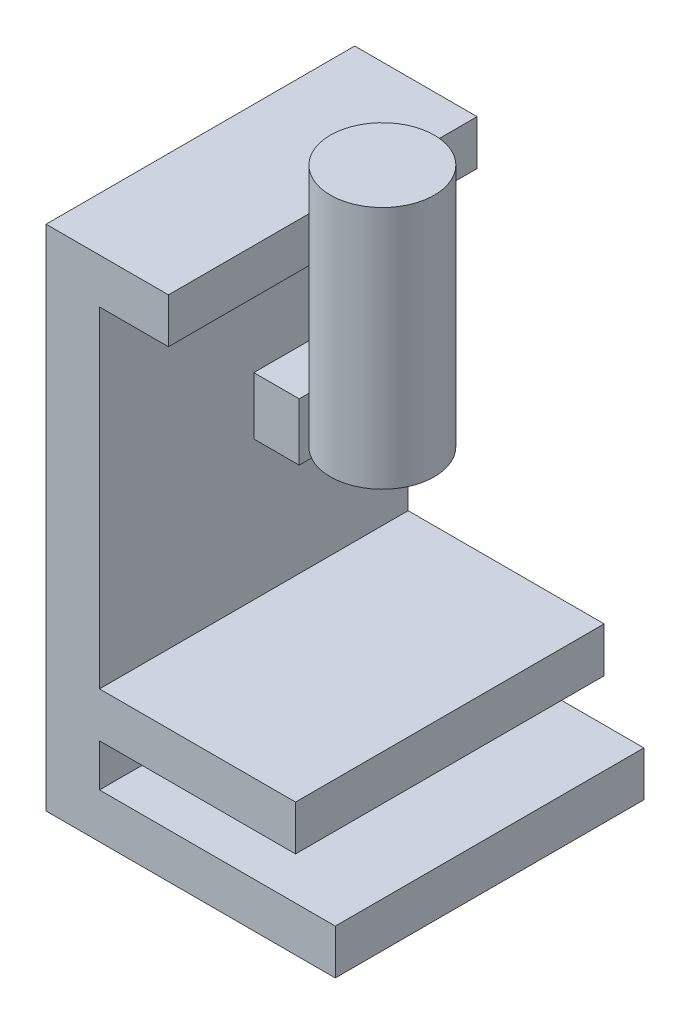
ISO-10303-21;
HEADER;
FILE_DESCRIPTION(('STEP AP214'),'2;1');
FILE_NAME('part.step','',(''),(''),'','','');
FILE_SCHEMA(('AUTOMOTIVE_DESIGN { 1 0 10303 214 1 1 1 1 }'));
ENDSEC;
DATA;
#1=APPLICATION_CONTEXT('core data for automotive mechanical design processes');
#2=APPLICATION_PROTOCOL_DEFINITION('international standard','automotive_design',2000,#1);
#3=PRODUCT_CONTEXT('',#1,'mechanical');
#4=PRODUCT('Part','Part','',(#3));
#5=PRODUCT_RELATED_PRODUCT_CATEGORY('part','',(#4));
#6=PRODUCT_DEFINITION_FORMATION('','',#4);
#7=PRODUCT_DEFINITION_CONTEXT('part definition',#1,'design');
#8=PRODUCT_DEFINITION('design','',#6,#7);
#9=PRODUCT_DEFINITION_SHAPE('','',#8);
#10=(LENGTH_UNIT() NAMED_UNIT(*) SI_UNIT(.MILLI.,.METRE.));
#11=(NAMED_UNIT(*) PLANE_ANGLE_UNIT() SI_UNIT($,.RADIAN.));
#12=(NAMED_UNIT(*) SI_UNIT($,.STERADIAN.) SOLID_ANGLE_UNIT());
#13=UNCERTAINTY_MEASURE_WITH_UNIT(LENGTH_MEASURE(1.E-05),#10,'distance_accuracy_value','');
#14=(GEOMETRIC_REPRESENTATION_CONTEXT(3) GLOBAL_UNCERTAINTY_ASSIGNED_CONTEXT((#13)) GLOBAL_UNIT_ASSIGNED_CONTEXT((#10,
#11,#12)) REPRESENTATION_CONTEXT('',''));
#15=CARTESIAN_POINT('',(0.,0.,0.));
#16=DIRECTION('',(0.,0.,1.));
#17=DIRECTION('',(1.,0.,0.));
#18=AXIS2_PLACEMENT_3D('',#15,#16,#17);
#19=CARTESIAN_POINT('',(118.997137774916,14.7914505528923,0.));
#20=DIRECTION('',(0.,1.,0.));
#21=DIRECTION('',(-1.,0.,0.));
#22=AXIS2_PLACEMENT_3D('',#19,#20,#21);
#23=CYLINDRICAL_SURFACE('',#22,15.9977414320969);
#24=CARTESIAN_POINT('',(118.997137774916,14.7914505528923,0.));
#25=DIRECTION('',(0.,1.,0.));
#26=DIRECTION('',(-1.,0.,0.));
#27=AXIS2_PLACEMENT_3D('',#24,#25,#26);
#28=CIRCLE('',#27,15.9977414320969);
#29=CARTESIAN_POINT('',(102.999396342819,14.7914505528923,0.));
#30=VERTEX_POINT('',#29);
#31=EDGE_CURVE('E11',#30,#30,#28,.T.);
#32=ORIENTED_EDGE('',*,*,#31,.T.);
#33=EDGE_LOOP('',(#32));
#34=FACE_BOUND('',#33,.T.);
#35=CARTESIAN_POINT('',(118.997137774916,89.8894366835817,0.));
#36=DIRECTION('',(0.,1.,0.));
#37=DIRECTION('',(-1.,0.,0.));
#38=AXIS2_PLACEMENT_3D('',#35,#36,#37);
#39=CIRCLE('',#38,15.9977414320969);
#40=CARTESIAN_POINT('',(102.999396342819,89.8894366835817,0.));
#41=VERTEX_POINT('',#40);
#42=EDGE_CURVE('E43',#41,#41,#39,.T.);
#43=ORIENTED_EDGE('',*,*,#42,.F.);
#44=EDGE_LOOP('',(#43));
#45=FACE_BOUND('',#44,.T.);
#46=ADVANCED_FACE('F40',(#34,#45),#23,.T.);
#47=CARTESIAN_POINT('',(118.997137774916,14.7914505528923,0.));
#48=DIRECTION('',(0.,1.,0.));
#49=DIRECTION('',(-1.,0.,0.));
#50=AXIS2_PLACEMENT_3D('',#47,#48,#49);
#51=PLANE('',#50);
#52=ORIENTED_EDGE('',*,*,#31,.F.);
#53=EDGE_LOOP('',(#52));
#54=FACE_BOUND('',#53,.T.);
#55=ADVANCED_FACE('F55',(#54),#51,.F.);
#56=CARTESIAN_POINT('',(118.997137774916,89.8894366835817,0.));
#57=DIRECTION('',(0.,1.,0.));
#58=DIRECTION('',(-1.,0.,0.));
#59=AXIS2_PLACEMENT_3D('',#56,#57,#58);
#60=PLANE('',#59);
#61=ORIENTED_EDGE('',*,*,#42,.T.);
#62=EDGE_LOOP('',(#61));
#63=FACE_BOUND('',#62,.T.);
#64=ADVANCED_FACE('F52',(#63),#60,.T.);
#65=CLOSED_SHELL('',(#46,#55,#64));
#66=MANIFOLD_SOLID_BREP('B2',#65);
#67=CARTESIAN_POINT('',(139.766211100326,-45.7667519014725,47.5));
#68=DIRECTION('',(0.,-1.,0.));
#69=DIRECTION('',(0.,0.,-1.));
#70=AXIS2_PLACEMENT_3D('',#67,#68,#69);
#71=PLANE('',#70);
#72=DIRECTION('',(-1.,0.,0.));
#73=VECTOR('',#72,1.);
#74=CARTESIAN_POINT('',(139.766211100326,-45.7667519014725,-47.5));
#75=LINE('',#74,#73);
#76=CARTESIAN_POINT('',(139.766211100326,-45.7667519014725,-47.5));
#77=VERTEX_POINT('',#76);
#78=CARTESIAN_POINT('',(79.4274220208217,-45.7667519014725,-47.5));
#79=VERTEX_POINT('',#78);
#80=EDGE_CURVE('E209',#77,#79,#75,.T.);
#81=ORIENTED_EDGE('',*,*,#80,.T.);
#82=DIRECTION('',(0.,0.,-1.));
#83=VECTOR('',#82,1.);
#84=CARTESIAN_POINT('',(79.4274220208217,-45.7667519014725,47.5));
#85=LINE('',#84,#83);
#86=CARTESIAN_POINT('',(79.4274220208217,-45.7667519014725,47.5));
#87=VERTEX_POINT('',#86);
#88=EDGE_CURVE('E38',#87,#79,#85,.T.);
#89=ORIENTED_EDGE('',*,*,#88,.F.);
#90=DIRECTION('',(-1.,0.,0.));
#91=VECTOR('',#90,1.);
#92=CARTESIAN_POINT('',(139.766211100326,-45.7667519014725,47.5));
#93=LINE('',#92,#91);
#94=CARTESIAN_POINT('',(139.766211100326,-45.7667519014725,47.5));
#95=VERTEX_POINT('',#94);
#96=EDGE_CURVE('E273',#95,#87,#93,.T.);
#97=ORIENTED_EDGE('',*,*,#96,.F.);
#98=DIRECTION('',(0.,0.,-1.));
#99=VECTOR('',#98,1.);
#100=CARTESIAN_POINT('',(139.766211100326,-45.7667519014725,47.5));
#101=LINE('',#100,#99);
#102=EDGE_CURVE('E250',#95,#77,#101,.T.);
#103=ORIENTED_EDGE('',*,*,#102,.T.);
#104=EDGE_LOOP('',(#81,#89,#97,#103));
#105=FACE_BOUND('',#104,.T.);
#106=ADVANCED_FACE('F80',(#105),#71,.F.);
#107=CARTESIAN_POINT('',(79.4274220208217,-2.89157012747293,47.5));
#108=DIRECTION('',(0.,1.,0.));
#109=DIRECTION('',(0.,0.,1.));
#110=AXIS2_PLACEMENT_3D('',#107,#108,#109);
#111=PLANE('',#110);
#112=DIRECTION('',(0.,0.,-1.));
#113=VECTOR('',#112,1.);
#114=CARTESIAN_POINT('',(93.3999473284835,-2.89157012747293,47.5));
#115=LINE('',#114,#113);
#116=CARTESIAN_POINT('',(93.3999473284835,-2.89157012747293,0.));
#117=VERTEX_POINT('',#116);
#118=CARTESIAN_POINT('',(93.3999473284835,-2.89157012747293,-47.5));
#119=VERTEX_POINT('',#118);
#120=EDGE_CURVE('E208',#117,#119,#115,.T.);
#121=ORIENTED_EDGE('',*,*,#120,.F.);
#122=DIRECTION('',(1.,0.,0.));
#123=VECTOR('',#122,1.);
#124=CARTESIAN_POINT('',(79.4274220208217,-2.89157012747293,0.));
#125=LINE('',#124,#123);
#126=CARTESIAN_POINT('',(79.4274220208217,-2.89157012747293,0.));
#127=VERTEX_POINT('',#126);
#128=EDGE_CURVE('E194',#127,#117,#125,.T.);
#129=ORIENTED_EDGE('',*,*,#128,.F.);
#130=DIRECTION('',(0.,0.,-1.));
#131=VECTOR('',#130,1.);
#132=CARTESIAN_POINT('',(79.4274220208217,-2.89157012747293,47.5));
#133=LINE('',#132,#131);
#134=CARTESIAN_POINT('',(79.4274220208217,-2.89157012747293,-47.5));
#135=VERTEX_POINT('',#134);
#136=EDGE_CURVE('E87',#127,#135,#133,.T.);
#137=ORIENTED_EDGE('',*,*,#136,.T.);
#138=DIRECTION('',(1.,0.,0.));
#139=VECTOR('',#138,1.);
#140=CARTESIAN_POINT('',(79.4274220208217,-2.89157012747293,-47.5));
#141=LINE('',#140,#139);
#142=EDGE_CURVE('E303',#135,#119,#141,.T.);
#143=ORIENTED_EDGE('',*,*,#142,.T.);
#144=EDGE_LOOP('',(#121,#129,#137,#143));
#145=FACE_BOUND('',#144,.T.);
#146=ADVANCED_FACE('F205',(#145),#111,.F.);
#147=CARTESIAN_POINT('',(93.3999473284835,-2.89157012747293,47.5));
#148=DIRECTION('',(-1.,0.,0.));
#149=DIRECTION('',(0.,0.,1.));
#150=AXIS2_PLACEMENT_3D('',#147,#148,#149);
#151=PLANE('',#150);
#152=DIRECTION('',(0.,0.,-1.));
#153=VECTOR('',#152,1.);
#154=CARTESIAN_POINT('',(93.3999473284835,14.7914505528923,47.5));
#155=LINE('',#154,#153);
#156=CARTESIAN_POINT('',(93.3999473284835,14.7914505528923,0.));
#157=VERTEX_POINT('',#156);
#158=CARTESIAN_POINT('',(93.3999473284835,14.7914505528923,-47.5));
#159=VERTEX_POINT('',#158);
#160=EDGE_CURVE('E214',#157,#159,#155,.T.);
#161=ORIENTED_EDGE('',*,*,#160,.F.);
#162=DIRECTION('',(0.,1.,0.));
#163=VECTOR('',#162,1.);
#164=CARTESIAN_POINT('',(93.3999473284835,-86.5522105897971,0.));
#165=LINE('',#164,#163);
#166=EDGE_CURVE('E201',#117,#157,#165,.T.);
#167=ORIENTED_EDGE('',*,*,#166,.F.);
#168=ORIENTED_EDGE('',*,*,#120,.T.);
#169=DIRECTION('',(0.,1.,0.));
#170=VECTOR('',#169,1.);
#171=CARTESIAN_POINT('',(93.3999473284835,-2.89157012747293,-47.5));
#172=LINE('',#171,#170);
#173=EDGE_CURVE('E300',#119,#159,#172,.T.);
#174=ORIENTED_EDGE('',*,*,#173,.T.);
#175=EDGE_LOOP('',(#161,#167,#168,#174));
#176=FACE_BOUND('',#175,.T.);
#177=ADVANCED_FACE('F313',(#176),#151,.F.);
#178=CARTESIAN_POINT('',(93.3999473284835,14.7914505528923,47.5));
#179=DIRECTION('',(0.,-1.,0.));
#180=DIRECTION('',(0.,0.,-1.));
#181=AXIS2_PLACEMENT_3D('',#178,#179,#180);
#182=PLANE('',#181);
#183=DIRECTION('',(0.,0.,-1.));
#184=VECTOR('',#183,1.);
#185=CARTESIAN_POINT('',(79.4274220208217,14.7914505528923,47.5));
#186=LINE('',#185,#184);
#187=CARTESIAN_POINT('',(79.4274220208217,14.7914505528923,0.));
#188=VERTEX_POINT('',#187);
#189=CARTESIAN_POINT('',(79.4274220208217,14.7914505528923,-47.5));
#190=VERTEX_POINT('',#189);
#191=EDGE_CURVE('E218',#188,#190,#186,.T.);
#192=ORIENTED_EDGE('',*,*,#191,.F.);
#193=DIRECTION('',(-1.,0.,0.));
#194=VECTOR('',#193,1.);
#195=CARTESIAN_POINT('',(79.4274220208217,14.7914505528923,0.));
#196=LINE('',#195,#194);
#197=EDGE_CURVE('E197',#157,#188,#196,.T.);
#198=ORIENTED_EDGE('',*,*,#197,.F.);
#199=ORIENTED_EDGE('',*,*,#160,.T.);
#200=DIRECTION('',(-1.,0.,0.));
#201=VECTOR('',#200,1.);
#202=CARTESIAN_POINT('',(93.3999473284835,14.7914505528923,-47.5));
#203=LINE('',#202,#201);
#204=EDGE_CURVE('E297',#159,#190,#203,.T.);
#205=ORIENTED_EDGE('',*,*,#204,.T.);
#206=EDGE_LOOP('',(#192,#198,#199,#205));
#207=FACE_BOUND('',#206,.T.);
#208=ADVANCED_FACE('F312',(#207),#182,.F.);
#209=CARTESIAN_POINT('',(79.4274220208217,14.7914505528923,47.5));
#210=DIRECTION('',(-1.,0.,0.));
#211=DIRECTION('',(0.,0.,1.));
#212=AXIS2_PLACEMENT_3D('',#209,#210,#211);
#213=PLANE('',#212);
#214=DIRECTION('',(0.,1.,0.));
#215=VECTOR('',#214,1.);
#216=CARTESIAN_POINT('',(79.4274220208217,14.7914505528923,-47.5));
#217=LINE('',#216,#215);
#218=CARTESIAN_POINT('',(79.4274220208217,56.0485401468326,-47.5));
#219=VERTEX_POINT('',#218);
#220=EDGE_CURVE('E295',#190,#219,#217,.T.);
#221=ORIENTED_EDGE('',*,*,#220,.T.);
#222=DIRECTION('',(0.,0.,-1.));
#223=VECTOR('',#222,1.);
#224=CARTESIAN_POINT('',(79.4274220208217,56.0485401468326,47.5));
#225=LINE('',#224,#223);
#226=CARTESIAN_POINT('',(79.4274220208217,56.0485401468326,47.5));
#227=VERTEX_POINT('',#226);
#228=EDGE_CURVE('E220',#227,#219,#225,.T.);
#229=ORIENTED_EDGE('',*,*,#228,.F.);
#230=DIRECTION('',(0.,1.,0.));
#231=VECTOR('',#230,1.);
#232=CARTESIAN_POINT('',(79.4274220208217,-45.7667519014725,47.5));
#233=LINE('',#232,#231);
#234=EDGE_CURVE('E271',#87,#227,#233,.T.);
#235=ORIENTED_EDGE('',*,*,#234,.F.);
#236=ORIENTED_EDGE('',*,*,#88,.T.);
#237=DIRECTION('',(0.,1.,0.));
#238=VECTOR('',#237,1.);
#239=CARTESIAN_POINT('',(79.4274220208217,-45.7667519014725,-47.5));
#240=LINE('',#239,#238);
#241=EDGE_CURVE('E212',#79,#135,#240,.T.);
#242=ORIENTED_EDGE('',*,*,#241,.T.);
#243=ORIENTED_EDGE('',*,*,#136,.F.);
#244=DIRECTION('',(0.,1.,0.));
#245=VECTOR('',#244,1.);
#246=CARTESIAN_POINT('',(79.4274220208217,-86.5522105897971,0.));
#247=LINE('',#246,#245);
#248=EDGE_CURVE('E191',#127,#188,#247,.T.);
#249=ORIENTED_EDGE('',*,*,#248,.T.);
#250=ORIENTED_EDGE('',*,*,#191,.T.);
#251=EDGE_LOOP('',(#221,#229,#235,#236,#242,#243,#249,#250));
#252=FACE_BOUND('',#251,.T.);
#253=ADVANCED_FACE('F211',(#252),#213,.F.);
#254=CARTESIAN_POINT('',(79.4274220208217,56.0485401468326,47.5));
#255=DIRECTION('',(0.,1.,0.));
#256=DIRECTION('',(0.,0.,1.));
#257=AXIS2_PLACEMENT_3D('',#254,#255,#256);
#258=PLANE('',#257);
#259=DIRECTION('',(1.,0.,0.));
#260=VECTOR('',#259,1.);
#261=CARTESIAN_POINT('',(79.4274220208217,56.0485401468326,-47.5));
#262=LINE('',#261,#260);
#263=CARTESIAN_POINT('',(100.6545595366,56.0485401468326,-47.5));
#264=VERTEX_POINT('',#263);
#265=EDGE_CURVE('E293',#219,#264,#262,.T.);
#266=ORIENTED_EDGE('',*,*,#265,.T.);
#267=DIRECTION('',(0.,0.,-1.));
#268=VECTOR('',#267,1.);
#269=CARTESIAN_POINT('',(100.6545595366,56.0485401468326,47.5));
#270=LINE('',#269,#268);
#271=CARTESIAN_POINT('',(100.6545595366,56.0485401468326,47.5));
#272=VERTEX_POINT('',#271);
#273=EDGE_CURVE('E223',#272,#264,#270,.T.);
#274=ORIENTED_EDGE('',*,*,#273,.F.);
#275=DIRECTION('',(1.,0.,0.));
#276=VECTOR('',#275,1.);
#277=CARTESIAN_POINT('',(79.4274220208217,56.0485401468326,47.5));
#278=LINE('',#277,#276);
#279=EDGE_CURVE('E269',#227,#272,#278,.T.);
#280=ORIENTED_EDGE('',*,*,#279,.F.);
#281=ORIENTED_EDGE('',*,*,#228,.T.);
#282=EDGE_LOOP('',(#266,#274,#280,#281));
#283=FACE_BOUND('',#282,.T.);
#284=ADVANCED_FACE('F325',(#283),#258,.F.);
#285=CARTESIAN_POINT('',(100.6545595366,56.0485401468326,47.5));
#286=DIRECTION('',(-1.,0.,0.));
#287=DIRECTION('',(0.,0.,1.));
#288=AXIS2_PLACEMENT_3D('',#285,#286,#287);
#289=PLANE('',#288);
#290=DIRECTION('',(0.,1.,0.));
#291=VECTOR('',#290,1.);
#292=CARTESIAN_POINT('',(100.6545595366,56.0485401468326,-47.5));
#293=LINE('',#292,#291);
#294=CARTESIAN_POINT('',(100.6545595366,69.8894366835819,-47.5));
#295=VERTEX_POINT('',#294);
#296=EDGE_CURVE('E291',#264,#295,#293,.T.);
#297=ORIENTED_EDGE('',*,*,#296,.T.);
#298=DIRECTION('',(0.,0.,-1.));
#299=VECTOR('',#298,1.);
#300=CARTESIAN_POINT('',(100.6545595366,69.8894366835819,47.5));
#301=LINE('',#300,#299);
#302=CARTESIAN_POINT('',(100.6545595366,69.8894366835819,47.5));
#303=VERTEX_POINT('',#302);
#304=EDGE_CURVE('E226',#303,#295,#301,.T.);
#305=ORIENTED_EDGE('',*,*,#304,.F.);
#306=DIRECTION('',(0.,1.,0.));
#307=VECTOR('',#306,1.);
#308=CARTESIAN_POINT('',(100.6545595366,56.0485401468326,47.5));
#309=LINE('',#308,#307);
#310=EDGE_CURVE('E267',#272,#303,#309,.T.);
#311=ORIENTED_EDGE('',*,*,#310,.F.);
#312=ORIENTED_EDGE('',*,*,#273,.T.);
#313=EDGE_LOOP('',(#297,#305,#311,#312));
#314=FACE_BOUND('',#313,.T.);
#315=ADVANCED_FACE('F370',(#314),#289,.F.);
#316=CARTESIAN_POINT('',(62.9855483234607,69.8894366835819,47.5));
#317=DIRECTION('',(0.,-1.,0.));
#318=DIRECTION('',(1.,0.,0.));
#319=AXIS2_PLACEMENT_3D('',#316,#317,#318);
#320=PLANE('',#319);
#321=DIRECTION('',(-1.,0.,0.));
#322=VECTOR('',#321,1.);
#323=CARTESIAN_POINT('',(62.9855483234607,69.8894366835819,-47.5));
#324=LINE('',#323,#322);
#325=CARTESIAN_POINT('',(62.9855483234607,69.8894366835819,-47.5));
#326=VERTEX_POINT('',#325);
#327=EDGE_CURVE('E289',#295,#326,#324,.T.);
#328=ORIENTED_EDGE('',*,*,#327,.T.);
#329=DIRECTION('',(0.,0.,-1.));
#330=VECTOR('',#329,1.);
#331=CARTESIAN_POINT('',(62.9855483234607,69.8894366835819,47.5));
#332=LINE('',#331,#330);
#333=CARTESIAN_POINT('',(62.9855483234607,69.8894366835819,47.5));
#334=VERTEX_POINT('',#333);
#335=EDGE_CURVE('E229',#334,#326,#332,.T.);
#336=ORIENTED_EDGE('',*,*,#335,.F.);
#337=DIRECTION('',(-1.,0.,0.));
#338=VECTOR('',#337,1.);
#339=CARTESIAN_POINT('',(62.9855483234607,69.8894366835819,47.5));
#340=LINE('',#339,#338);
#341=EDGE_CURVE('E265',#303,#334,#340,.T.);
#342=ORIENTED_EDGE('',*,*,#341,.F.);
#343=ORIENTED_EDGE('',*,*,#304,.T.);
#344=EDGE_LOOP('',(#328,#336,#342,#343));
#345=FACE_BOUND('',#344,.T.);
#346=ADVANCED_FACE('F368',(#345),#320,.F.);
#347=CARTESIAN_POINT('',(62.9855483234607,-86.5512105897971,47.5));
#348=DIRECTION('',(1.,0.,0.));
#349=DIRECTION('',(0.,0.,-1.));
#350=AXIS2_PLACEMENT_3D('',#347,#348,#349);
#351=PLANE('',#350);
#352=DIRECTION('',(0.,-1.,0.));
#353=VECTOR('',#352,1.);
#354=CARTESIAN_POINT('',(62.9855483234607,-86.5512105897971,-47.5));
#355=LINE('',#354,#353);
#356=CARTESIAN_POINT('',(62.9855483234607,-86.5512105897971,-47.5));
#357=VERTEX_POINT('',#356);
#358=EDGE_CURVE('E287',#326,#357,#355,.T.);
#359=ORIENTED_EDGE('',*,*,#358,.T.);
#360=DIRECTION('',(0.,0.,-1.));
#361=VECTOR('',#360,1.);
#362=CARTESIAN_POINT('',(62.9855483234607,-86.5512105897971,47.5));
#363=LINE('',#362,#361);
#364=CARTESIAN_POINT('',(62.9855483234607,-86.5512105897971,47.5));
#365=VERTEX_POINT('',#364);
#366=EDGE_CURVE('E232',#365,#357,#363,.T.);
#367=ORIENTED_EDGE('',*,*,#366,.F.);
#368=DIRECTION('',(0.,-1.,0.));
#369=VECTOR('',#368,1.);
#370=CARTESIAN_POINT('',(62.9855483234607,-86.5512105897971,47.5));
#371=LINE('',#370,#369);
#372=EDGE_CURVE('E263',#334,#365,#371,.T.);
#373=ORIENTED_EDGE('',*,*,#372,.F.);
#374=ORIENTED_EDGE('',*,*,#335,.T.);
#375=EDGE_LOOP('',(#359,#367,#373,#374));
#376=FACE_BOUND('',#375,.T.);
#377=ADVANCED_FACE('F363',(#376),#351,.F.);
#378=CARTESIAN_POINT('',(152.004557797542,-86.5512105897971,47.5));
#379=DIRECTION('',(0.,1.,0.));
#380=DIRECTION('',(0.,0.,1.));
#381=AXIS2_PLACEMENT_3D('',#378,#379,#380);
#382=PLANE('',#381);
#383=DIRECTION('',(1.,0.,0.));
#384=VECTOR('',#383,1.);
#385=CARTESIAN_POINT('',(152.004557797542,-86.5512105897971,-47.5));
#386=LINE('',#385,#384);
#387=CARTESIAN_POINT('',(152.004557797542,-86.5512105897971,-47.5));
#388=VERTEX_POINT('',#387);
#389=EDGE_CURVE('E285',#357,#388,#386,.T.);
#390=ORIENTED_EDGE('',*,*,#389,.T.);
#391=DIRECTION('',(0.,0.,-1.));
#392=VECTOR('',#391,1.);
#393=CARTESIAN_POINT('',(152.004557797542,-86.5512105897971,47.5));
#394=LINE('',#393,#392);
#395=CARTESIAN_POINT('',(152.004557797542,-86.5512105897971,47.5));
#396=VERTEX_POINT('',#395);
#397=EDGE_CURVE('E235',#396,#388,#394,.T.);
#398=ORIENTED_EDGE('',*,*,#397,.F.);
#399=DIRECTION('',(1.,0.,0.));
#400=VECTOR('',#399,1.);
#401=CARTESIAN_POINT('',(152.004557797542,-86.5512105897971,47.5));
#402=LINE('',#401,#400);
#403=EDGE_CURVE('E261',#365,#396,#402,.T.);
#404=ORIENTED_EDGE('',*,*,#403,.F.);
#405=ORIENTED_EDGE('',*,*,#366,.T.);
#406=EDGE_LOOP('',(#390,#398,#404,#405));
#407=FACE_BOUND('',#406,.T.);
#408=ADVANCED_FACE('F358',(#407),#382,.F.);
#409=CARTESIAN_POINT('',(152.004557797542,-86.5512105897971,47.5));
#410=DIRECTION('',(-1.,0.,0.));
#411=DIRECTION('',(0.,0.,1.));
#412=AXIS2_PLACEMENT_3D('',#409,#410,#411);
#413=PLANE('',#412);
#414=DIRECTION('',(0.,1.,0.));
#415=VECTOR('',#414,1.);
#416=CARTESIAN_POINT('',(152.004557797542,-86.5512105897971,-47.5));
#417=LINE('',#416,#415);
#418=CARTESIAN_POINT('',(152.004557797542,-72.710314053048,-47.5));
#419=VERTEX_POINT('',#418);
#420=EDGE_CURVE('E283',#388,#419,#417,.T.);
#421=ORIENTED_EDGE('',*,*,#420,.T.);
#422=DIRECTION('',(0.,0.,-1.));
#423=VECTOR('',#422,1.);
#424=CARTESIAN_POINT('',(152.004557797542,-72.710314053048,47.5));
#425=LINE('',#424,#423);
#426=CARTESIAN_POINT('',(152.004557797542,-72.710314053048,47.5));
#427=VERTEX_POINT('',#426);
#428=EDGE_CURVE('E238',#427,#419,#425,.T.);
#429=ORIENTED_EDGE('',*,*,#428,.F.);
#430=DIRECTION('',(0.,1.,0.));
#431=VECTOR('',#430,1.);
#432=CARTESIAN_POINT('',(152.004557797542,-86.5512105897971,47.5));
#433=LINE('',#432,#431);
#434=EDGE_CURVE('E259',#396,#427,#433,.T.);
#435=ORIENTED_EDGE('',*,*,#434,.F.);
#436=ORIENTED_EDGE('',*,*,#397,.T.);
#437=EDGE_LOOP('',(#421,#429,#435,#436));
#438=FACE_BOUND('',#437,.T.);
#439=ADVANCED_FACE('F354',(#438),#413,.F.);
#440=CARTESIAN_POINT('',(152.004557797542,-72.710314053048,47.5));
#441=DIRECTION('',(0.,-1.,0.));
#442=DIRECTION('',(1.,0.,0.));
#443=AXIS2_PLACEMENT_3D('',#440,#441,#442);
#444=PLANE('',#443);
#445=DIRECTION('',(-1.,0.,0.));
#446=VECTOR('',#445,1.);
#447=CARTESIAN_POINT('',(152.004557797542,-72.710314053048,-47.5));
#448=LINE('',#447,#446);
#449=CARTESIAN_POINT('',(79.4274220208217,-72.7103140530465,-47.5));
#450=VERTEX_POINT('',#449);
#451=EDGE_CURVE('E281',#419,#450,#448,.T.);
#452=ORIENTED_EDGE('',*,*,#451,.T.);
#453=DIRECTION('',(0.,0.,-1.));
#454=VECTOR('',#453,1.);
#455=CARTESIAN_POINT('',(79.4274220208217,-72.7103140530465,47.5));
#456=LINE('',#455,#454);
#457=CARTESIAN_POINT('',(79.4274220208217,-72.7103140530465,47.5));
#458=VERTEX_POINT('',#457);
#459=EDGE_CURVE('E241',#458,#450,#456,.T.);
#460=ORIENTED_EDGE('',*,*,#459,.F.);
#461=DIRECTION('',(-1.,0.,0.));
#462=VECTOR('',#461,1.);
#463=CARTESIAN_POINT('',(152.004557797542,-72.710314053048,47.5));
#464=LINE('',#463,#462);
#465=EDGE_CURVE('E257',#427,#458,#464,.T.);
#466=ORIENTED_EDGE('',*,*,#465,.F.);
#467=ORIENTED_EDGE('',*,*,#428,.T.);
#468=EDGE_LOOP('',(#452,#460,#466,#467));
#469=FACE_BOUND('',#468,.T.);
#470=ADVANCED_FACE('F349',(#469),#444,.F.);
#471=CARTESIAN_POINT('',(79.4274220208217,-72.7103140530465,47.5));
#472=DIRECTION('',(-1.,0.,0.));
#473=DIRECTION('',(0.,0.,1.));
#474=AXIS2_PLACEMENT_3D('',#471,#472,#473);
#475=PLANE('',#474);
#476=DIRECTION('',(0.,1.,0.));
#477=VECTOR('',#476,1.);
#478=CARTESIAN_POINT('',(79.4274220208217,-72.7103140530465,-47.5));
#479=LINE('',#478,#477);
#480=CARTESIAN_POINT('',(79.4274220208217,-59.6076484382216,-47.5));
#481=VERTEX_POINT('',#480);
#482=EDGE_CURVE('E279',#450,#481,#479,.T.);
#483=ORIENTED_EDGE('',*,*,#482,.T.);
#484=DIRECTION('',(0.,0.,-1.));
#485=VECTOR('',#484,1.);
#486=CARTESIAN_POINT('',(79.4274220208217,-59.6076484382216,47.5));
#487=LINE('',#486,#485);
#488=CARTESIAN_POINT('',(79.4274220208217,-59.6076484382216,47.5));
#489=VERTEX_POINT('',#488);
#490=EDGE_CURVE('E244',#489,#481,#487,.T.);
#491=ORIENTED_EDGE('',*,*,#490,.F.);
#492=DIRECTION('',(0.,1.,0.));
#493=VECTOR('',#492,1.);
#494=CARTESIAN_POINT('',(79.4274220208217,-72.7103140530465,47.5));
#495=LINE('',#494,#493);
#496=EDGE_CURVE('E255',#458,#489,#495,.T.);
#497=ORIENTED_EDGE('',*,*,#496,.F.);
#498=ORIENTED_EDGE('',*,*,#459,.T.);
#499=EDGE_LOOP('',(#483,#491,#497,#498));
#500=FACE_BOUND('',#499,.T.);
#501=ADVANCED_FACE('F343',(#500),#475,.F.);
#502=CARTESIAN_POINT('',(79.4274220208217,-59.6076484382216,47.5));
#503=DIRECTION('',(0.,1.,0.));
#504=DIRECTION('',(0.,0.,1.));
#505=AXIS2_PLACEMENT_3D('',#502,#503,#504);
#506=PLANE('',#505);
#507=DIRECTION('',(1.,0.,0.));
#508=VECTOR('',#507,1.);
#509=CARTESIAN_POINT('',(79.4274220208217,-59.6076484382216,-47.5));
#510=LINE('',#509,#508);
#511=CARTESIAN_POINT('',(139.766211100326,-59.6076484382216,-47.5));
#512=VERTEX_POINT('',#511);
#513=EDGE_CURVE('E277',#481,#512,#510,.T.);
#514=ORIENTED_EDGE('',*,*,#513,.T.);
#515=DIRECTION('',(0.,0.,-1.));
#516=VECTOR('',#515,1.);
#517=CARTESIAN_POINT('',(139.766211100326,-59.6076484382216,47.5));
#518=LINE('',#517,#516);
#519=CARTESIAN_POINT('',(139.766211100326,-59.6076484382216,47.5));
#520=VERTEX_POINT('',#519);
#521=EDGE_CURVE('E247',#520,#512,#518,.T.);
#522=ORIENTED_EDGE('',*,*,#521,.F.);
#523=DIRECTION('',(1.,0.,0.));
#524=VECTOR('',#523,1.);
#525=CARTESIAN_POINT('',(79.4274220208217,-59.6076484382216,47.5));
#526=LINE('',#525,#524);
#527=EDGE_CURVE('E99',#489,#520,#526,.T.);
#528=ORIENTED_EDGE('',*,*,#527,.F.);
#529=ORIENTED_EDGE('',*,*,#490,.T.);
#530=EDGE_LOOP('',(#514,#522,#528,#529));
#531=FACE_BOUND('',#530,.T.);
#532=ADVANCED_FACE('F339',(#531),#506,.F.);
#533=CARTESIAN_POINT('',(139.766211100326,-59.6076484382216,47.5));
#534=DIRECTION('',(-1.,0.,0.));
#535=DIRECTION('',(0.,0.,1.));
#536=AXIS2_PLACEMENT_3D('',#533,#534,#535);
#537=PLANE('',#536);
#538=DIRECTION('',(0.,1.,0.));
#539=VECTOR('',#538,1.);
#540=CARTESIAN_POINT('',(139.766211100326,-59.6076484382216,-47.5));
#541=LINE('',#540,#539);
#542=EDGE_CURVE('E275',#512,#77,#541,.T.);
#543=ORIENTED_EDGE('',*,*,#542,.T.);
#544=ORIENTED_EDGE('',*,*,#102,.F.);
#545=DIRECTION('',(0.,1.,0.));
#546=VECTOR('',#545,1.);
#547=CARTESIAN_POINT('',(139.766211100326,-59.6076484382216,47.5));
#548=LINE('',#547,#546);
#549=EDGE_CURVE('E94',#520,#95,#548,.T.);
#550=ORIENTED_EDGE('',*,*,#549,.F.);
#551=ORIENTED_EDGE('',*,*,#521,.T.);
#552=EDGE_LOOP('',(#543,#544,#550,#551));
#553=FACE_BOUND('',#552,.T.);
#554=ADVANCED_FACE('F337',(#553),#537,.F.);
#555=CARTESIAN_POINT('',(79.4274220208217,-45.7667519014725,47.5));
#556=DIRECTION('',(0.,0.,-1.));
#557=DIRECTION('',(-1.,0.,0.));
#558=AXIS2_PLACEMENT_3D('',#555,#556,#557);
#559=PLANE('',#558);
#560=ORIENTED_EDGE('',*,*,#234,.T.);
#561=ORIENTED_EDGE('',*,*,#279,.T.);
#562=ORIENTED_EDGE('',*,*,#310,.T.);
#563=ORIENTED_EDGE('',*,*,#341,.T.);
#564=ORIENTED_EDGE('',*,*,#372,.T.);
#565=ORIENTED_EDGE('',*,*,#403,.T.);
#566=ORIENTED_EDGE('',*,*,#434,.T.);
#567=ORIENTED_EDGE('',*,*,#465,.T.);
#568=ORIENTED_EDGE('',*,*,#496,.T.);
#569=ORIENTED_EDGE('',*,*,#527,.T.);
#570=ORIENTED_EDGE('',*,*,#549,.T.);
#571=ORIENTED_EDGE('',*,*,#96,.T.);
#572=EDGE_LOOP('',(#560,#561,#562,#563,#564,#565,#566,#567,#568,#569,#570,#571));
#573=FACE_BOUND('',#572,.T.);
#574=ADVANCED_FACE('F328',(#573),#559,.F.);
#575=CARTESIAN_POINT('',(79.4274220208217,-45.7667519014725,-47.5));
#576=DIRECTION('',(0.,0.,-1.));
#577=DIRECTION('',(-1.,0.,0.));
#578=AXIS2_PLACEMENT_3D('',#575,#576,#577);
#579=PLANE('',#578);
#580=ORIENTED_EDGE('',*,*,#80,.F.);
#581=ORIENTED_EDGE('',*,*,#542,.F.);
#582=ORIENTED_EDGE('',*,*,#513,.F.);
#583=ORIENTED_EDGE('',*,*,#482,.F.);
#584=ORIENTED_EDGE('',*,*,#451,.F.);
#585=ORIENTED_EDGE('',*,*,#420,.F.);
#586=ORIENTED_EDGE('',*,*,#389,.F.);
#587=ORIENTED_EDGE('',*,*,#358,.F.);
#588=ORIENTED_EDGE('',*,*,#327,.F.);
#589=ORIENTED_EDGE('',*,*,#296,.F.);
#590=ORIENTED_EDGE('',*,*,#265,.F.);
#591=ORIENTED_EDGE('',*,*,#220,.F.);
#592=ORIENTED_EDGE('',*,*,#204,.F.);
#593=ORIENTED_EDGE('',*,*,#173,.F.);
#594=ORIENTED_EDGE('',*,*,#142,.F.);
#595=ORIENTED_EDGE('',*,*,#241,.F.);
#596=EDGE_LOOP('',(#580,#581,#582,#583,#584,#585,#586,#587,#588,#589,#590,#591,#592,#593,#594,#595));
#597=FACE_BOUND('',#596,.T.);
#598=ADVANCED_FACE('F319',(#597),#579,.T.);
#599=CARTESIAN_POINT('',(79.4274220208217,-86.5522105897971,0.));
#600=DIRECTION('',(0.,0.,-1.));
#601=DIRECTION('',(-1.,0.,0.));
#602=AXIS2_PLACEMENT_3D('',#599,#600,#601);
#603=PLANE('',#602);
#604=ORIENTED_EDGE('',*,*,#128,.T.);
#605=ORIENTED_EDGE('',*,*,#166,.T.);
#606=ORIENTED_EDGE('',*,*,#197,.T.);
#607=ORIENTED_EDGE('',*,*,#248,.F.);
#608=EDGE_LOOP('',(#604,#605,#606,#607));
#609=FACE_BOUND('',#608,.T.);
#610=ADVANCED_FACE('F193',(#609),#603,.F.);
#611=CLOSED_SHELL('',(#106,#146,#177,#208,#253,#284,#315,#346,#377,#408,#439,#470,#501,#532,
#554,#574,#598,#610));
#612=MANIFOLD_SOLID_BREP('B6',#611);
#613=ADVANCED_BREP_SHAPE_REPRESENTATION('',(#18,#66,#612),#14);
#614=SHAPE_DEFINITION_REPRESENTATION(#9,#613);
ENDSEC;
END-ISO-10303-21;
